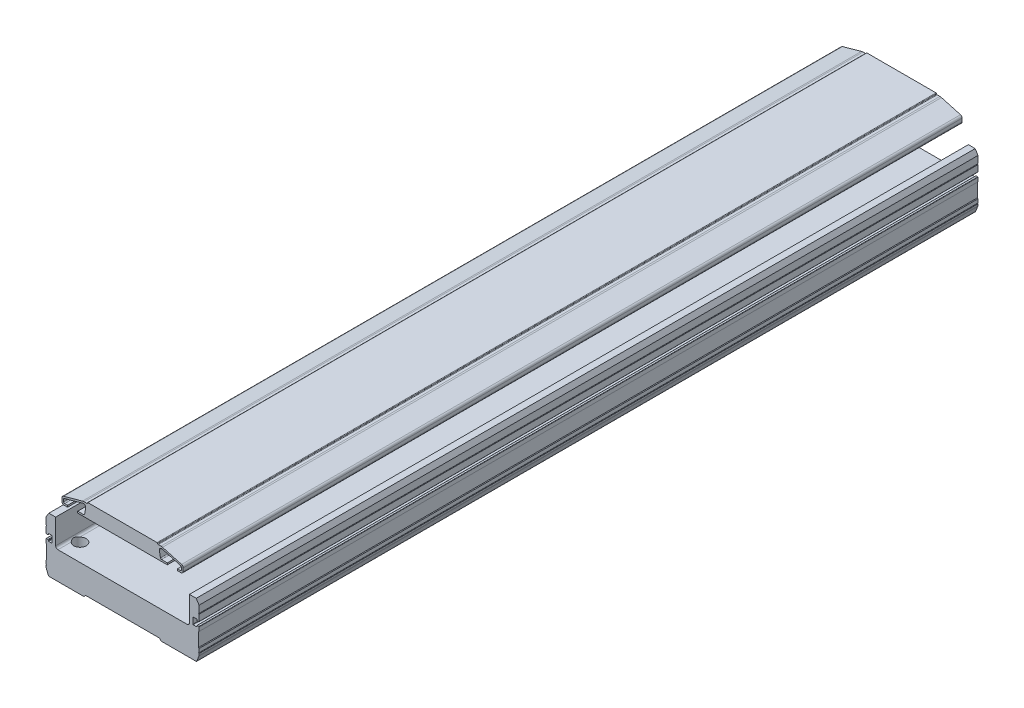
from build123d import *

# Parameters (mm, degrees)
EXTRUDE_1_DEPTH             = 687
EXTRUDE_1_2_DEPTH           = 687
HOLE_WIZARD_1_AT_2_COUNT    = 2
HOLE_WIZARD_1_AT_2_PITCH    = 106
HOLE_WIZARD_1_AT_3_COUNT    = 2
HOLE_WIZARD_1_AT_3_PITCH    = 226.353705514
HOLE_WIZARD_1_AT_4_COUNT    = 2
HOLE_WIZARD_1_AT_4_PITCH    = 200
HOLE_WIZARD_1_AT_5_COUNT    = 2
HOLE_WIZARD_1_AT_5_PITCH    = 413.806718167
HOLE_WIZARD_1_AT_6_COUNT    = 2
HOLE_WIZARD_1_AT_6_PITCH    = 400
HOLE_WIZARD_1_AT_7_COUNT    = 2
HOLE_WIZARD_1_AT_7_PITCH    = 609.2913917
HOLE_WIZARD_1_AT_8_COUNT    = 2
HOLE_WIZARD_1_AT_8_PITCH    = 600
HOLE_WIZARD_M6_0_AT_2_COUNT = 2
HOLE_WIZARD_M6_0_AT_2_PITCH = 106
HOLE_WIZARD_M6_0_AT_3_COUNT = 2
HOLE_WIZARD_M6_0_AT_3_PITCH = 200
HOLE_WIZARD_M6_0_AT_4_COUNT = 2
HOLE_WIZARD_M6_0_AT_4_PITCH = 226.353705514
HOLE_WIZARD_M6_0_AT_5_COUNT = 2
HOLE_WIZARD_M6_0_AT_5_PITCH = 413.806718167
HOLE_WIZARD_M6_0_AT_6_COUNT = 2
HOLE_WIZARD_M6_0_AT_6_PITCH = 400
HOLE_WIZARD_M6_0_AT_7_COUNT = 2
HOLE_WIZARD_M6_0_AT_7_PITCH = 609.2913917
HOLE_WIZARD_M6_0_AT_8_COUNT = 2
HOLE_WIZARD_M6_0_AT_8_PITCH = 600


with BuildPart() as part:
    # Sketch 1 → Extrude 1 (new body)
    with BuildSketch(Plane.XY):
        with BuildLine():
            Line((-39.5, 59.4), (39.5, 59.4))
            Line((39.5, 59.4), (39.5, 60.9))
            Line((39.5, 60.9), (34.4, 60.9))
            ThreePointArc((34.4, 60.9), (33.754110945, 61.136568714), (33.413816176, 61.734345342))
            Line((33.413816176, 61.734345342), (32.536146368, 66.959334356))
            ThreePointArc((32.536146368, 66.959334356), (33.171932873, 68.778444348), (35.048529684, 69.216359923))
            Line((35.048529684, 69.216359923), (51.270007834, 64.667479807))
            ThreePointArc((51.270007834, 64.667479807), (51.79687133, 64.308770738), (52, 63.704621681))
            Line((52, 63.704621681), (52, 61.9))
            ThreePointArc((52, 61.9), (51.707106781, 61.192893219), (51, 60.9))
            Line((51, 60.9), (48.5, 60.9))
            Line((48.5, 60.9), (48.5, 59.4))
            Line((48.5, 59.4), (51.5, 59.4))
            ThreePointArc((51.5, 59.4), (52.914213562, 59.985786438), (53.5, 61.4))
            Line((53.5, 61.4), (53.5, 64.083697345))
            ThreePointArc((53.5, 64.083697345), (53.093742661, 65.291995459), (52.040015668, 66.009413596))
            Line((52.040015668, 66.009413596), (35.262246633, 70.714290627))
            ThreePointArc((35.262246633, 70.714290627), (34.593583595, 70.853355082), (33.912207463, 70.9))
            Line((33.912207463, 70.9), (31.5, 70.9))
            ThreePointArc((31.5, 70.9), (31.146446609, 71.046446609), (31, 71.4))
            ThreePointArc((31, 71.4), (30.853553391, 71.753553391), (30.5, 71.9))
            Line((30.5, 71.9), (-30.5, 71.9))
            ThreePointArc((-30.5, 71.9), (-30.853553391, 71.753553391), (-31, 71.4))
            ThreePointArc((-31, 71.4), (-31.146446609, 71.046446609), (-31.5, 70.9))
            Line((-31.5, 70.9), (-33.912207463, 70.9))
            ThreePointArc((-33.912207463, 70.9), (-34.593583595, 70.853355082), (-35.262246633, 70.714290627))
            Line((-35.262246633, 70.714290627), (-52.040015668, 66.009413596))
            ThreePointArc((-52.040015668, 66.009413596), (-53.093742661, 65.291995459), (-53.5, 64.083697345))
            Line((-53.5, 64.083697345), (-53.5, 61.4))
            ThreePointArc((-53.5, 61.4), (-52.914213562, 59.985786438), (-51.5, 59.4))
            Line((-51.5, 59.4), (-48.5, 59.4))
            Line((-48.5, 59.4), (-48.5, 60.9))
            Line((-48.5, 60.9), (-51, 60.9))
            ThreePointArc((-51, 60.9), (-51.707106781, 61.192893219), (-52, 61.9))
            Line((-52, 61.9), (-52, 63.704621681))
            ThreePointArc((-52, 63.704621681), (-51.79687133, 64.308770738), (-51.270007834, 64.667479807))
            Line((-51.270007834, 64.667479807), (-35.048529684, 69.216359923))
            ThreePointArc((-35.048529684, 69.216359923), (-33.171932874, 68.778444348), (-32.536146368, 66.959334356))
            Line((-32.536146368, 66.959334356), (-33.413816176, 61.734345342))
            ThreePointArc((-33.413816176, 61.734345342), (-33.754110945, 61.136568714), (-34.4, 60.9))
            Line((-34.4, 60.9), (-39.5, 60.9))
            Line((-39.5, 60.9), (-39.5, 59.4))
        make_face()
    extrude(amount=-EXTRUDE_1_DEPTH)


with BuildPart() as body_2:
    # Sketch 1 → Extrude 1 2 (new body)
    with BuildSketch(Plane.XY):
        with BuildLine():
            Line((-67, 22), (-67, 10))
            Line((-67, 10), (-67.5, 9.5))
            Line((-67.5, 9.5), (-67.5, 6.375))
            ThreePointArc((-67.5, 6.375), (-67.125, 6), (-67.5, 5.625))
            Line((-67.5, 5.625), (-67.49999984, 4.381168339))
            ThreePointArc((-67.49999984, 4.381168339), (-67.464614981, 4.007418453), (-67.360006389, 3.646865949))
            Line((-67.360006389, 3.646865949), (-65.506419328, -1.028852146))
            ThreePointArc((-65.506419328, -1.028852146), (-65.35722349, -1.328991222), (-65.16, -1.6))
            Line((-65.16, -1.6), (-34.1, -1.6))
            Line((-34.1, -1.6), (-32.5, 0))
            Line((-32.5, 0), (32.5, 0))
            Line((32.5, 0), (34.1, -1.6))
            Line((34.1, -1.6), (65.16, -1.6))
            ThreePointArc((65.16, -1.6), (65.35722349, -1.328991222), (65.506419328, -1.028852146))
            Line((65.506419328, -1.028852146), (67.360006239, 3.646865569))
            ThreePointArc((67.360006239, 3.646865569), (67.464614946, 4.007418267), (67.499999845, 4.381168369))
            Line((67.499999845, 4.381168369), (67.499999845, 5.625000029))
            ThreePointArc((67.499999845, 5.625000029), (67.124999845, 6.000000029), (67.499999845, 6.375000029))
            Line((67.499999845, 6.375000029), (67.499999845, 9.500000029))
            Line((67.499999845, 9.500000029), (66.999999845, 10.000000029))
            Line((66.999999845, 10.000000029), (66.999999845, 22.000000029))
            Line((66.999999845, 22.000000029), (67.499999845, 22.500000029))
            Line((67.499999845, 22.500000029), (67.499999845, 25.900000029))
            ThreePointArc((67.499999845, 25.900000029), (67.41213188, 26.112132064), (67.199999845, 26.200000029))
            Line((67.199999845, 26.200000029), (65.799999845, 26.200000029))
            ThreePointArc((65.799999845, 26.200000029), (65.587867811, 26.112132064), (65.499999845, 25.900000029))
            Line((65.499999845, 25.900000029), (65.499999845, 25.300000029))
            ThreePointArc((65.499999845, 25.300000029), (65.41213188, 25.087867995), (65.199999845, 25.000000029))
            Line((65.199999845, 25.000000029), (62.299999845, 25.000000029))
            ThreePointArc((62.299999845, 25.000000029), (62.087867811, 25.087867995), (61.999999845, 25.300000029))
            Line((61.999999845, 25.300000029), (61.999999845, 30.700000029))
            ThreePointArc((61.999999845, 30.700000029), (62.087867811, 30.912132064), (62.299999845, 31.000000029))
            Line((62.299999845, 31.000000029), (65.199999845, 31.000000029))
            ThreePointArc((65.199999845, 31.000000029), (65.41213188, 30.912132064), (65.499999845, 30.700000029))
            Line((65.499999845, 30.700000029), (65.499999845, 30.100000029))
            ThreePointArc((65.499999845, 30.100000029), (65.587867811, 29.887867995), (65.799999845, 29.800000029))
            Line((65.799999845, 29.800000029), (67.199999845, 29.800000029))
            ThreePointArc((67.199999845, 29.800000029), (67.41213188, 29.887867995), (67.499999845, 30.100000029))
            Line((67.499999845, 30.100000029), (67.499999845, 35.625000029))
            ThreePointArc((67.499999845, 35.625000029), (67.124999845, 36.000000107), (67.5, 36.375000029))
            Line((67.5, 36.375000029), (67.5, 42.6))
            Line((67.5, 42.6), (65, 46.6))
            Line((65, 46.6), (59, 46.6))
            Line((59, 46.6), (59, 24.7))
            ThreePointArc((59, 24.7), (58.414213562, 23.285786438), (57, 22.7))
            Line((57, 22.7), (-57, 22.7))
            ThreePointArc((-57, 22.7), (-58.414213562, 23.285786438), (-59, 24.7))
            Line((-59, 24.7), (-59, 46.6))
            Line((-59, 46.6), (-65, 46.6))
            Line((-65, 46.6), (-67.5, 42.6))
            Line((-67.5, 42.6), (-67.5, 36.375))
            ThreePointArc((-67.5, 36.375), (-67.125, 36), (-67.5, 35.625))
            Line((-67.5, 35.625), (-67.5, 30.1))
            ThreePointArc((-67.5, 30.1), (-67.412132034, 29.887867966), (-67.2, 29.8))
            Line((-67.2, 29.8), (-65.8, 29.8))
            ThreePointArc((-65.8, 29.8), (-65.587867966, 29.887867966), (-65.5, 30.1))
            Line((-65.5, 30.1), (-65.5, 30.7))
            ThreePointArc((-65.5, 30.7), (-65.412132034, 30.912132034), (-65.2, 31))
            Line((-65.2, 31), (-62.3, 31))
            ThreePointArc((-62.3, 31), (-62.087867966, 30.912132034), (-62, 30.7))
            Line((-62, 30.7), (-62, 25.3))
            ThreePointArc((-62, 25.3), (-62.087867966, 25.087867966), (-62.3, 25))
            Line((-62.3, 25), (-65.2, 25))
            ThreePointArc((-65.2, 25), (-65.412132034, 25.087867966), (-65.5, 25.3))
            Line((-65.5, 25.3), (-65.5, 25.9))
            ThreePointArc((-65.5, 25.9), (-65.587867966, 26.112132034), (-65.8, 26.2))
            Line((-65.8, 26.2), (-67.2, 26.2))
            ThreePointArc((-67.2, 26.2), (-67.412132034, 26.112132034), (-67.5, 25.9))
            Line((-67.5, 25.9), (-67.5, 22.5))
            Line((-67.5, 22.5), (-67, 22))
        make_face()
    extrude(amount=-EXTRUDE_1_2_DEPTH)

    # Sketch 4 → Hole Wizard 1 (revolve, cut)
    with BuildSketch(Plane(origin=(-53, 46.6, -615.5), x_dir=(0, 0, 1), z_dir=(1, 0, 0))):
        Polygon((0, 0), (0, 48.2), (3.5, 48.2), (3.5, 41), (5.5, 41), (5.5, 0), align=None)
    hole_wizard_1 = revolve(axis=Axis((-53, 52.95, -615.5), (0, -1, 0)), mode=Mode.SUBTRACT)

    # Hole Wizard 1 at 2: Hole Wizard 1 ×2
    with Locations(*[(i * HOLE_WIZARD_1_AT_2_PITCH, 0, 0) for i in range(1, HOLE_WIZARD_1_AT_2_COUNT)]):
        add(hole_wizard_1, mode=Mode.SUBTRACT)

    # Hole Wizard 1 at 3: Hole Wizard 1 ×2
    with Locations(*[Vector(0.46829363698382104, 9.315616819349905e-14, 0.8835728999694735) * (i * HOLE_WIZARD_1_AT_3_PITCH) for i in range(1, HOLE_WIZARD_1_AT_3_COUNT)]):
        add(hole_wizard_1, mode=Mode.SUBTRACT)

    # Hole Wizard 1 at 4: Hole Wizard 1 ×2
    with Locations(*[(0, 0, i * HOLE_WIZARD_1_AT_4_PITCH) for i in range(1, HOLE_WIZARD_1_AT_4_COUNT)]):
        add(hole_wizard_1, mode=Mode.SUBTRACT)

    # Hole Wizard 1 at 5: Hole Wizard 1 ×2
    with Locations(*[Vector(0.2561582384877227, 5.095674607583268e-14, 0.9666348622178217) * (i * HOLE_WIZARD_1_AT_5_PITCH) for i in range(1, HOLE_WIZARD_1_AT_5_COUNT)]):
        add(hole_wizard_1, mode=Mode.SUBTRACT)

    # Hole Wizard 1 at 6: Hole Wizard 1 ×2
    with Locations(*[(0, 0, i * HOLE_WIZARD_1_AT_6_PITCH) for i in range(1, HOLE_WIZARD_1_AT_6_COUNT)]):
        add(hole_wizard_1, mode=Mode.SUBTRACT)

    # Hole Wizard 1 at 7: Hole Wizard 1 ×2
    with Locations(*[Vector(0.17397258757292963, 3.460781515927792e-14, 0.9847504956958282) * (i * HOLE_WIZARD_1_AT_7_PITCH) for i in range(1, HOLE_WIZARD_1_AT_7_COUNT)]):
        add(hole_wizard_1, mode=Mode.SUBTRACT)

    # Hole Wizard 1 at 8: Hole Wizard 1 ×2
    with Locations(*[(0, 0, i * HOLE_WIZARD_1_AT_8_PITCH) for i in range(1, HOLE_WIZARD_1_AT_8_COUNT)]):
        add(hole_wizard_1, mode=Mode.SUBTRACT)

    # Sketch 6 → Hole Wizard M6 _0 (revolve, cut)
    with BuildSketch(Plane(origin=(-53, -1.6, -625.5), x_dir=(0, 0, -1), z_dir=(1, 0, 0))):
        Polygon((0, 0), (0, 16.502151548), (2.5, 15), (2.5, 0), align=None)
    hole_wizard_m6_0 = revolve(axis=Axis((-53, -7.95, -625.5), (0, 1, 0)), mode=Mode.SUBTRACT)

    # Hole Wizard M6 _0 at 2: Hole Wizard M6 _0 ×2
    with Locations(*[(i * HOLE_WIZARD_M6_0_AT_2_PITCH, 0, 0) for i in range(1, HOLE_WIZARD_M6_0_AT_2_COUNT)]):
        add(hole_wizard_m6_0, mode=Mode.SUBTRACT)

    # Hole Wizard M6 _0 at 3: Hole Wizard M6 _0 ×2
    with Locations(*[(0, 0, i * HOLE_WIZARD_M6_0_AT_3_PITCH) for i in range(1, HOLE_WIZARD_M6_0_AT_3_COUNT)]):
        add(hole_wizard_m6_0, mode=Mode.SUBTRACT)

    # Hole Wizard M6 _0 at 4: Hole Wizard M6 _0 ×2
    with Locations(*[Vector(0.4682936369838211, 0, 0.8835728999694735) * (i * HOLE_WIZARD_M6_0_AT_4_PITCH) for i in range(1, HOLE_WIZARD_M6_0_AT_4_COUNT)]):
        add(hole_wizard_m6_0, mode=Mode.SUBTRACT)

    # Hole Wizard M6 _0 at 5: Hole Wizard M6 _0 ×2
    with Locations(*[Vector(0.25615823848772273, 0, 0.9666348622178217) * (i * HOLE_WIZARD_M6_0_AT_5_PITCH) for i in range(1, HOLE_WIZARD_M6_0_AT_5_COUNT)]):
        add(hole_wizard_m6_0, mode=Mode.SUBTRACT)

    # Hole Wizard M6 _0 at 6: Hole Wizard M6 _0 ×2
    with Locations(*[(0, 0, i * HOLE_WIZARD_M6_0_AT_6_PITCH) for i in range(1, HOLE_WIZARD_M6_0_AT_6_COUNT)]):
        add(hole_wizard_m6_0, mode=Mode.SUBTRACT)

    # Hole Wizard M6 _0 at 7: Hole Wizard M6 _0 ×2
    with Locations(*[Vector(0.17397258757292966, 0, 0.9847504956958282) * (i * HOLE_WIZARD_M6_0_AT_7_PITCH) for i in range(1, HOLE_WIZARD_M6_0_AT_7_COUNT)]):
        add(hole_wizard_m6_0, mode=Mode.SUBTRACT)

    # Hole Wizard M6 _0 at 8: Hole Wizard M6 _0 ×2
    with Locations(*[(0, 0, i * HOLE_WIZARD_M6_0_AT_8_PITCH) for i in range(1, HOLE_WIZARD_M6_0_AT_8_COUNT)]):
        add(hole_wizard_m6_0, mode=Mode.SUBTRACT)


solid = Compound([part.part, body_2.part])
